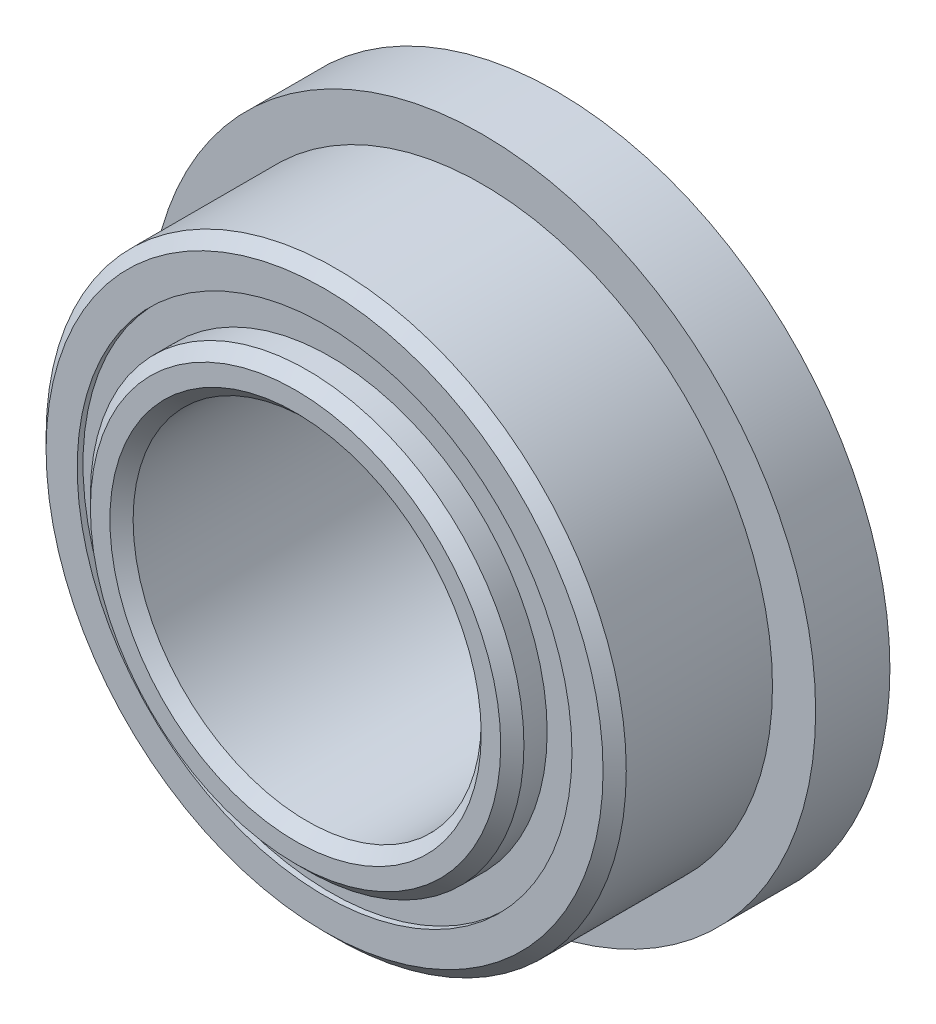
ISO-10303-21;
HEADER;
FILE_DESCRIPTION(('STEP AP214'),'2;1');
FILE_NAME('part.step','',(''),(''),'','','');
FILE_SCHEMA(('AUTOMOTIVE_DESIGN { 1 0 10303 214 1 1 1 1 }'));
ENDSEC;
DATA;
#1=APPLICATION_CONTEXT('core data for automotive mechanical design processes');
#2=APPLICATION_PROTOCOL_DEFINITION('international standard','automotive_design',2000,#1);
#3=PRODUCT_CONTEXT('',#1,'mechanical');
#4=PRODUCT('Part','Part','',(#3));
#5=PRODUCT_RELATED_PRODUCT_CATEGORY('part','',(#4));
#6=PRODUCT_DEFINITION_FORMATION('','',#4);
#7=PRODUCT_DEFINITION_CONTEXT('part definition',#1,'design');
#8=PRODUCT_DEFINITION('design','',#6,#7);
#9=PRODUCT_DEFINITION_SHAPE('','',#8);
#10=(LENGTH_UNIT() NAMED_UNIT(*) SI_UNIT(.MILLI.,.METRE.));
#11=(NAMED_UNIT(*) PLANE_ANGLE_UNIT() SI_UNIT($,.RADIAN.));
#12=(NAMED_UNIT(*) SI_UNIT($,.STERADIAN.) SOLID_ANGLE_UNIT());
#13=UNCERTAINTY_MEASURE_WITH_UNIT(LENGTH_MEASURE(1.E-05),#10,'distance_accuracy_value','');
#14=(GEOMETRIC_REPRESENTATION_CONTEXT(3) GLOBAL_UNCERTAINTY_ASSIGNED_CONTEXT((#13)) GLOBAL_UNIT_ASSIGNED_CONTEXT((#10,
#11,#12)) REPRESENTATION_CONTEXT('',''));
#15=CARTESIAN_POINT('',(0.,0.,0.));
#16=DIRECTION('',(0.,0.,1.));
#17=DIRECTION('',(1.,0.,0.));
#18=AXIS2_PLACEMENT_3D('',#15,#16,#17);
#19=CARTESIAN_POINT('',(0.,3.38434065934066,-1.508125));
#20=DIRECTION('',(0.,0.,1.));
#21=DIRECTION('',(1.,0.,0.));
#22=AXIS2_PLACEMENT_3D('',#19,#20,#21);
#23=PLANE('',#22);
#24=CARTESIAN_POINT('',(0.,0.,-1.508125));
#25=DIRECTION('',(0.,0.,1.));
#26=DIRECTION('',(1.,0.,0.));
#27=AXIS2_PLACEMENT_3D('',#24,#25,#26);
#28=CIRCLE('',#27,3.38434065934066);
#29=CARTESIAN_POINT('',(3.38434065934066,0.,-1.508125));
#30=VERTEX_POINT('',#29);
#31=EDGE_CURVE('E55',#30,#30,#28,.T.);
#32=ORIENTED_EDGE('',*,*,#31,.F.);
#33=EDGE_LOOP('',(#32));
#34=FACE_BOUND('',#33,.T.);
#35=CARTESIAN_POINT('',(0.,0.,-1.508125));
#36=DIRECTION('',(0.,0.,1.));
#37=DIRECTION('',(1.,0.,0.));
#38=AXIS2_PLACEMENT_3D('',#35,#36,#37);
#39=CIRCLE('',#38,2.96565934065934);
#40=CARTESIAN_POINT('',(2.96565934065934,0.,-1.508125));
#41=VERTEX_POINT('',#40);
#42=EDGE_CURVE('E11',#41,#41,#39,.T.);
#43=ORIENTED_EDGE('',*,*,#42,.T.);
#44=EDGE_LOOP('',(#43));
#45=FACE_BOUND('',#44,.T.);
#46=ADVANCED_FACE('F41',(#34,#45),#23,.F.);
#47=CARTESIAN_POINT('',(0.,0.,1.5875));
#48=DIRECTION('',(0.,0.,1.));
#49=DIRECTION('',(1.,0.,0.));
#50=AXIS2_PLACEMENT_3D('',#47,#48,#49);
#51=CYLINDRICAL_SURFACE('',#50,2.96565934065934);
#52=ORIENTED_EDGE('',*,*,#42,.F.);
#53=EDGE_LOOP('',(#52));
#54=FACE_BOUND('',#53,.T.);
#55=CARTESIAN_POINT('',(0.,0.,-0.735956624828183));
#56=DIRECTION('',(0.,0.,1.));
#57=DIRECTION('',(1.,0.,0.));
#58=AXIS2_PLACEMENT_3D('',#55,#56,#57);
#59=CIRCLE('',#58,2.96565934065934);
#60=CARTESIAN_POINT('',(2.96565934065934,0.,-0.735956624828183));
#61=VERTEX_POINT('',#60);
#62=EDGE_CURVE('E47',#61,#61,#59,.T.);
#63=ORIENTED_EDGE('',*,*,#62,.T.);
#64=EDGE_LOOP('',(#63));
#65=FACE_BOUND('',#64,.T.);
#66=ADVANCED_FACE('F64',(#54,#65),#51,.F.);
#67=CARTESIAN_POINT('',(0.,3.38434065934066,-0.735956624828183));
#68=DIRECTION('',(0.,0.,-1.));
#69=DIRECTION('',(-1.,0.,0.));
#70=AXIS2_PLACEMENT_3D('',#67,#68,#69);
#71=PLANE('',#70);
#72=ORIENTED_EDGE('',*,*,#62,.F.);
#73=EDGE_LOOP('',(#72));
#74=FACE_BOUND('',#73,.T.);
#75=CARTESIAN_POINT('',(0.,0.,-0.735956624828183));
#76=DIRECTION('',(0.,0.,1.));
#77=DIRECTION('',(1.,0.,0.));
#78=AXIS2_PLACEMENT_3D('',#75,#76,#77);
#79=CIRCLE('',#78,3.38434065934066);
#80=CARTESIAN_POINT('',(3.38434065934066,0.,-0.735956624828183));
#81=VERTEX_POINT('',#80);
#82=EDGE_CURVE('E51',#81,#81,#79,.T.);
#83=ORIENTED_EDGE('',*,*,#82,.T.);
#84=EDGE_LOOP('',(#83));
#85=FACE_BOUND('',#84,.T.);
#86=ADVANCED_FACE('F68',(#74,#85),#71,.F.);
#87=CARTESIAN_POINT('',(0.,0.,1.5875));
#88=DIRECTION('',(0.,0.,1.));
#89=DIRECTION('',(1.,0.,0.));
#90=AXIS2_PLACEMENT_3D('',#87,#88,#89);
#91=CYLINDRICAL_SURFACE('',#90,3.38434065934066);
#92=ORIENTED_EDGE('',*,*,#82,.F.);
#93=EDGE_LOOP('',(#92));
#94=FACE_BOUND('',#93,.T.);
#95=ORIENTED_EDGE('',*,*,#31,.T.);
#96=EDGE_LOOP('',(#95));
#97=FACE_BOUND('',#96,.T.);
#98=ADVANCED_FACE('F61',(#94,#97),#91,.T.);
#99=CLOSED_SHELL('',(#46,#66,#86,#98));
#100=MANIFOLD_SOLID_BREP('B2',#99);
#101=CARTESIAN_POINT('',(0.,3.38434065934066,1.508125));
#102=DIRECTION('',(0.,0.,-1.));
#103=DIRECTION('',(-1.,0.,0.));
#104=AXIS2_PLACEMENT_3D('',#101,#102,#103);
#105=PLANE('',#104);
#106=CARTESIAN_POINT('',(0.,0.,1.508125));
#107=DIRECTION('',(0.,0.,1.));
#108=DIRECTION('',(1.,0.,0.));
#109=AXIS2_PLACEMENT_3D('',#106,#107,#108);
#110=CIRCLE('',#109,2.96565934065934);
#111=CARTESIAN_POINT('',(2.96565934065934,0.,1.508125));
#112=VERTEX_POINT('',#111);
#113=EDGE_CURVE('E40',#112,#112,#110,.T.);
#114=ORIENTED_EDGE('',*,*,#113,.F.);
#115=EDGE_LOOP('',(#114));
#116=FACE_BOUND('',#115,.T.);
#117=CARTESIAN_POINT('',(0.,0.,1.508125));
#118=DIRECTION('',(0.,0.,1.));
#119=DIRECTION('',(1.,0.,0.));
#120=AXIS2_PLACEMENT_3D('',#117,#118,#119);
#121=CIRCLE('',#120,3.38434065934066);
#122=CARTESIAN_POINT('',(3.38434065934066,0.,1.508125));
#123=VERTEX_POINT('',#122);
#124=EDGE_CURVE('E122',#123,#123,#121,.T.);
#125=ORIENTED_EDGE('',*,*,#124,.T.);
#126=EDGE_LOOP('',(#125));
#127=FACE_BOUND('',#126,.T.);
#128=ADVANCED_FACE('F108',(#116,#127),#105,.F.);
#129=CARTESIAN_POINT('',(0.,0.,1.5875));
#130=DIRECTION('',(0.,0.,1.));
#131=DIRECTION('',(1.,0.,0.));
#132=AXIS2_PLACEMENT_3D('',#129,#130,#131);
#133=CYLINDRICAL_SURFACE('',#132,2.96565934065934);
#134=CARTESIAN_POINT('',(0.,0.,0.735956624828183));
#135=DIRECTION('',(0.,0.,1.));
#136=DIRECTION('',(1.,0.,0.));
#137=AXIS2_PLACEMENT_3D('',#134,#135,#136);
#138=CIRCLE('',#137,2.96565934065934);
#139=CARTESIAN_POINT('',(2.96565934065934,0.,0.735956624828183));
#140=VERTEX_POINT('',#139);
#141=EDGE_CURVE('E114',#140,#140,#138,.T.);
#142=ORIENTED_EDGE('',*,*,#141,.F.);
#143=EDGE_LOOP('',(#142));
#144=FACE_BOUND('',#143,.T.);
#145=ORIENTED_EDGE('',*,*,#113,.T.);
#146=EDGE_LOOP('',(#145));
#147=FACE_BOUND('',#146,.T.);
#148=ADVANCED_FACE('F137',(#144,#147),#133,.F.);
#149=CARTESIAN_POINT('',(0.,3.38434065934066,0.735956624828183));
#150=DIRECTION('',(0.,0.,1.));
#151=DIRECTION('',(1.,0.,0.));
#152=AXIS2_PLACEMENT_3D('',#149,#150,#151);
#153=PLANE('',#152);
#154=CARTESIAN_POINT('',(0.,0.,0.735956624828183));
#155=DIRECTION('',(0.,0.,1.));
#156=DIRECTION('',(1.,0.,0.));
#157=AXIS2_PLACEMENT_3D('',#154,#155,#156);
#158=CIRCLE('',#157,3.38434065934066);
#159=CARTESIAN_POINT('',(3.38434065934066,0.,0.735956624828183));
#160=VERTEX_POINT('',#159);
#161=EDGE_CURVE('E118',#160,#160,#158,.T.);
#162=ORIENTED_EDGE('',*,*,#161,.F.);
#163=EDGE_LOOP('',(#162));
#164=FACE_BOUND('',#163,.T.);
#165=ORIENTED_EDGE('',*,*,#141,.T.);
#166=EDGE_LOOP('',(#165));
#167=FACE_BOUND('',#166,.T.);
#168=ADVANCED_FACE('F132',(#164,#167),#153,.F.);
#169=CARTESIAN_POINT('',(0.,0.,1.5875));
#170=DIRECTION('',(0.,0.,1.));
#171=DIRECTION('',(1.,0.,0.));
#172=AXIS2_PLACEMENT_3D('',#169,#170,#171);
#173=CYLINDRICAL_SURFACE('',#172,3.38434065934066);
#174=ORIENTED_EDGE('',*,*,#124,.F.);
#175=EDGE_LOOP('',(#174));
#176=FACE_BOUND('',#175,.T.);
#177=ORIENTED_EDGE('',*,*,#161,.T.);
#178=EDGE_LOOP('',(#177));
#179=FACE_BOUND('',#178,.T.);
#180=ADVANCED_FACE('F129',(#176,#179),#173,.T.);
#181=CLOSED_SHELL('',(#128,#148,#168,#180));
#182=MANIFOLD_SOLID_BREP('B6',#181);
#183=CARTESIAN_POINT('',(-1.86621817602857,2.56862895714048,0.));
#184=DIRECTION('',(0.,0.,1.));
#185=DIRECTION('',(-0.587785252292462,0.809016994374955,0.));
#186=AXIS2_PLACEMENT_3D('',#183,#184,#185);
#187=SPHERICAL_SURFACE('',#186,0.735956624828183);
#188=CARTESIAN_POINT('',(-1.86621817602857,2.56862895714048,0.735956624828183));
#189=VERTEX_POINT('',#188);
#190=VERTEX_LOOP('',#189);
#191=FACE_BOUND('',#190,.T.);
#192=ADVANCED_FACE('F175',(#191),#187,.T.);
#193=CLOSED_SHELL('',(#192));
#194=MANIFOLD_SOLID_BREP('B35',#193);
#195=CARTESIAN_POINT('',(-3.0196044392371,0.981128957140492,0.));
#196=DIRECTION('',(0.,0.,1.));
#197=DIRECTION('',(-0.95105651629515,0.309016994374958,0.));
#198=AXIS2_PLACEMENT_3D('',#195,#196,#197);
#199=SPHERICAL_SURFACE('',#198,0.735956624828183);
#200=CARTESIAN_POINT('',(-3.0196044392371,0.981128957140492,0.735956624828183));
#201=VERTEX_POINT('',#200);
#202=VERTEX_LOOP('',#201);
#203=FACE_BOUND('',#202,.T.);
#204=ADVANCED_FACE('F195',(#203),#199,.T.);
#205=CLOSED_SHELL('',(#204));
#206=MANIFOLD_SOLID_BREP('B104',#205);
#207=CARTESIAN_POINT('',(-3.01960443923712,-0.981128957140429,0.));
#208=DIRECTION('',(0.,0.,1.));
#209=DIRECTION('',(-0.951056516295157,-0.309016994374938,0.));
#210=AXIS2_PLACEMENT_3D('',#207,#208,#209);
#211=SPHERICAL_SURFACE('',#210,0.735956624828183);
#212=CARTESIAN_POINT('',(-3.01960443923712,-0.981128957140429,0.735956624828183));
#213=VERTEX_POINT('',#212);
#214=VERTEX_LOOP('',#213);
#215=FACE_BOUND('',#214,.T.);
#216=ADVANCED_FACE('F215',(#215),#211,.T.);
#217=CLOSED_SHELL('',(#216));
#218=MANIFOLD_SOLID_BREP('B171',#217);
#219=CARTESIAN_POINT('',(-1.86621817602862,-2.56862895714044,0.));
#220=DIRECTION('',(0.,0.,1.));
#221=DIRECTION('',(-0.58778525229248,-0.809016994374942,0.));
#222=AXIS2_PLACEMENT_3D('',#219,#220,#221);
#223=SPHERICAL_SURFACE('',#222,0.735956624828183);
#224=CARTESIAN_POINT('',(-1.86621817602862,-2.56862895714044,0.735956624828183));
#225=VERTEX_POINT('',#224);
#226=VERTEX_LOOP('',#225);
#227=FACE_BOUND('',#226,.T.);
#228=ADVANCED_FACE('F235',(#227),#223,.T.);
#229=CLOSED_SHELL('',(#228));
#230=MANIFOLD_SOLID_BREP('B191',#229);
#231=CARTESIAN_POINT('',(0.,-3.175,0.));
#232=DIRECTION('',(0.,0.,1.));
#233=DIRECTION('',(0.,-1.,0.));
#234=AXIS2_PLACEMENT_3D('',#231,#232,#233);
#235=SPHERICAL_SURFACE('',#234,0.735956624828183);
#236=CARTESIAN_POINT('',(0.,-3.175,0.735956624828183));
#237=VERTEX_POINT('',#236);
#238=VERTEX_LOOP('',#237);
#239=FACE_BOUND('',#238,.T.);
#240=ADVANCED_FACE('F255',(#239),#235,.T.);
#241=CLOSED_SHELL('',(#240));
#242=MANIFOLD_SOLID_BREP('B211',#241);
#243=CARTESIAN_POINT('',(1.86621817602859,-2.56862895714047,0.));
#244=DIRECTION('',(0.,0.,1.));
#245=DIRECTION('',(0.587785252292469,-0.809016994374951,0.));
#246=AXIS2_PLACEMENT_3D('',#243,#244,#245);
#247=SPHERICAL_SURFACE('',#246,0.735956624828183);
#248=CARTESIAN_POINT('',(1.86621817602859,-2.56862895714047,0.735956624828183));
#249=VERTEX_POINT('',#248);
#250=VERTEX_LOOP('',#249);
#251=FACE_BOUND('',#250,.T.);
#252=ADVANCED_FACE('F275',(#251),#247,.T.);
#253=CLOSED_SHELL('',(#252));
#254=MANIFOLD_SOLID_BREP('B231',#253);
#255=CARTESIAN_POINT('',(3.01960443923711,-0.981128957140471,0.));
#256=DIRECTION('',(0.,0.,1.));
#257=DIRECTION('',(0.951056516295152,-0.309016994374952,0.));
#258=AXIS2_PLACEMENT_3D('',#255,#256,#257);
#259=SPHERICAL_SURFACE('',#258,0.735956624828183);
#260=CARTESIAN_POINT('',(3.01960443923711,-0.981128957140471,0.735956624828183));
#261=VERTEX_POINT('',#260);
#262=VERTEX_LOOP('',#261);
#263=FACE_BOUND('',#262,.T.);
#264=ADVANCED_FACE('F295',(#263),#259,.T.);
#265=CLOSED_SHELL('',(#264));
#266=MANIFOLD_SOLID_BREP('B251',#265);
#267=CARTESIAN_POINT('',(3.01960443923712,0.98112895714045,0.));
#268=DIRECTION('',(0.,0.,1.));
#269=DIRECTION('',(0.951056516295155,0.309016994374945,0.));
#270=AXIS2_PLACEMENT_3D('',#267,#268,#269);
#271=SPHERICAL_SURFACE('',#270,0.735956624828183);
#272=CARTESIAN_POINT('',(3.01960443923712,0.98112895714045,0.735956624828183));
#273=VERTEX_POINT('',#272);
#274=VERTEX_LOOP('',#273);
#275=FACE_BOUND('',#274,.T.);
#276=ADVANCED_FACE('F315',(#275),#271,.T.);
#277=CLOSED_SHELL('',(#276));
#278=MANIFOLD_SOLID_BREP('B271',#277);
#279=CARTESIAN_POINT('',(1.86621817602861,2.56862895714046,0.));
#280=DIRECTION('',(0.,0.,1.));
#281=DIRECTION('',(0.587785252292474,0.809016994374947,0.));
#282=AXIS2_PLACEMENT_3D('',#279,#280,#281);
#283=SPHERICAL_SURFACE('',#282,0.735956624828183);
#284=CARTESIAN_POINT('',(1.86621817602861,2.56862895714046,0.735956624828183));
#285=VERTEX_POINT('',#284);
#286=VERTEX_LOOP('',#285);
#287=FACE_BOUND('',#286,.T.);
#288=ADVANCED_FACE('F335',(#287),#283,.T.);
#289=CLOSED_SHELL('',(#288));
#290=MANIFOLD_SOLID_BREP('B291',#289);
#291=CARTESIAN_POINT('',(0.,3.175,0.));
#292=DIRECTION('',(0.,0.,1.));
#293=DIRECTION('',(0.,1.,0.));
#294=AXIS2_PLACEMENT_3D('',#291,#292,#293);
#295=SPHERICAL_SURFACE('',#294,0.735956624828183);
#296=CARTESIAN_POINT('',(0.,3.175,0.735956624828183));
#297=VERTEX_POINT('',#296);
#298=VERTEX_LOOP('',#297);
#299=FACE_BOUND('',#298,.T.);
#300=ADVANCED_FACE('F357',(#299),#295,.T.);
#301=CLOSED_SHELL('',(#300));
#302=MANIFOLD_SOLID_BREP('B311',#301);
#303=CARTESIAN_POINT('',(0.,0.,1.825625));
#304=DIRECTION('',(0.,0.,-1.));
#305=DIRECTION('',(-1.,0.,0.));
#306=AXIS2_PLACEMENT_3D('',#303,#304,#305);
#307=CONICAL_SURFACE('',#306,2.96565934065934,0.785398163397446);
#308=CARTESIAN_POINT('',(0.,0.,1.984375));
#309=DIRECTION('',(0.,0.,1.));
#310=DIRECTION('',(1.,0.,0.));
#311=AXIS2_PLACEMENT_3D('',#308,#309,#310);
#312=CIRCLE('',#311,2.80690934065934);
#313=CARTESIAN_POINT('',(2.80690934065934,0.,1.984375));
#314=VERTEX_POINT('',#313);
#315=EDGE_CURVE('E410',#314,#314,#312,.T.);
#316=ORIENTED_EDGE('',*,*,#315,.F.);
#317=EDGE_LOOP('',(#316));
#318=FACE_BOUND('',#317,.T.);
#319=CARTESIAN_POINT('',(0.,0.,1.825625));
#320=DIRECTION('',(0.,0.,1.));
#321=DIRECTION('',(1.,0.,0.));
#322=AXIS2_PLACEMENT_3D('',#319,#320,#321);
#323=CIRCLE('',#322,2.96565934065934);
#324=CARTESIAN_POINT('',(2.96565934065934,0.,1.825625));
#325=VERTEX_POINT('',#324);
#326=EDGE_CURVE('E356',#325,#325,#323,.T.);
#327=ORIENTED_EDGE('',*,*,#326,.T.);
#328=EDGE_LOOP('',(#327));
#329=FACE_BOUND('',#328,.T.);
#330=ADVANCED_FACE('F376',(#318,#329),#307,.T.);
#331=CARTESIAN_POINT('',(0.,0.,1.5875));
#332=DIRECTION('',(0.,0.,1.));
#333=DIRECTION('',(1.,0.,0.));
#334=AXIS2_PLACEMENT_3D('',#331,#332,#333);
#335=CYLINDRICAL_SURFACE('',#334,2.96565934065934);
#336=ORIENTED_EDGE('',*,*,#326,.F.);
#337=EDGE_LOOP('',(#336));
#338=FACE_BOUND('',#337,.T.);
#339=CARTESIAN_POINT('',(0.,0.,0.705555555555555));
#340=DIRECTION('',(0.,0.,1.));
#341=DIRECTION('',(1.,0.,0.));
#342=AXIS2_PLACEMENT_3D('',#339,#340,#341);
#343=CIRCLE('',#342,2.96565934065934);
#344=CARTESIAN_POINT('',(2.96565934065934,0.,0.705555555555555));
#345=VERTEX_POINT('',#344);
#346=EDGE_CURVE('E382',#345,#345,#343,.T.);
#347=ORIENTED_EDGE('',*,*,#346,.T.);
#348=EDGE_LOOP('',(#347));
#349=FACE_BOUND('',#348,.T.);
#350=ADVANCED_FACE('F417',(#338,#349),#335,.T.);
#351=CARTESIAN_POINT('',(0.,0.,0.));
#352=DIRECTION('',(0.,0.,1.));
#353=DIRECTION('',(1.,0.,0.));
#354=AXIS2_PLACEMENT_3D('',#351,#352,#353);
#355=TOROIDAL_SURFACE('',#354,3.175,0.735956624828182);
#356=ORIENTED_EDGE('',*,*,#346,.F.);
#357=EDGE_LOOP('',(#356));
#358=FACE_BOUND('',#357,.T.);
#359=CARTESIAN_POINT('',(0.,0.,-0.705555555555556));
#360=DIRECTION('',(0.,0.,1.));
#361=DIRECTION('',(1.,0.,0.));
#362=AXIS2_PLACEMENT_3D('',#359,#360,#361);
#363=CIRCLE('',#362,2.96565934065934);
#364=CARTESIAN_POINT('',(2.96565934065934,0.,-0.705555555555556));
#365=VERTEX_POINT('',#364);
#366=EDGE_CURVE('E386',#365,#365,#363,.T.);
#367=ORIENTED_EDGE('',*,*,#366,.T.);
#368=EDGE_LOOP('',(#367));
#369=FACE_BOUND('',#368,.T.);
#370=ADVANCED_FACE('F421',(#358,#369),#355,.F.);
#371=CARTESIAN_POINT('',(0.,0.,1.5875));
#372=DIRECTION('',(0.,0.,1.));
#373=DIRECTION('',(1.,0.,0.));
#374=AXIS2_PLACEMENT_3D('',#371,#372,#373);
#375=CYLINDRICAL_SURFACE('',#374,2.96565934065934);
#376=ORIENTED_EDGE('',*,*,#366,.F.);
#377=EDGE_LOOP('',(#376));
#378=FACE_BOUND('',#377,.T.);
#379=CARTESIAN_POINT('',(0.,0.,-1.825625));
#380=DIRECTION('',(0.,0.,1.));
#381=DIRECTION('',(1.,0.,0.));
#382=AXIS2_PLACEMENT_3D('',#379,#380,#381);
#383=CIRCLE('',#382,2.96565934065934);
#384=CARTESIAN_POINT('',(2.96565934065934,0.,-1.825625));
#385=VERTEX_POINT('',#384);
#386=EDGE_CURVE('E390',#385,#385,#383,.T.);
#387=ORIENTED_EDGE('',*,*,#386,.T.);
#388=EDGE_LOOP('',(#387));
#389=FACE_BOUND('',#388,.T.);
#390=ADVANCED_FACE('F426',(#378,#389),#375,.T.);
#391=CARTESIAN_POINT('',(0.,0.,-1.984375));
#392=DIRECTION('',(0.,0.,1.));
#393=DIRECTION('',(1.,0.,0.));
#394=AXIS2_PLACEMENT_3D('',#391,#392,#393);
#395=CONICAL_SURFACE('',#394,2.80690934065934,0.78539816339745);
#396=ORIENTED_EDGE('',*,*,#386,.F.);
#397=EDGE_LOOP('',(#396));
#398=FACE_BOUND('',#397,.T.);
#399=CARTESIAN_POINT('',(0.,0.,-1.984375));
#400=DIRECTION('',(0.,0.,1.));
#401=DIRECTION('',(1.,0.,0.));
#402=AXIS2_PLACEMENT_3D('',#399,#400,#401);
#403=CIRCLE('',#402,2.80690934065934);
#404=CARTESIAN_POINT('',(2.80690934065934,0.,-1.984375));
#405=VERTEX_POINT('',#404);
#406=EDGE_CURVE('E395',#405,#405,#403,.T.);
#407=ORIENTED_EDGE('',*,*,#406,.T.);
#408=EDGE_LOOP('',(#407));
#409=FACE_BOUND('',#408,.T.);
#410=ADVANCED_FACE('F432',(#398,#409),#395,.T.);
#411=CARTESIAN_POINT('',(0.,2.80690934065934,-1.984375));
#412=DIRECTION('',(0.,0.,1.));
#413=DIRECTION('',(1.,0.,0.));
#414=AXIS2_PLACEMENT_3D('',#411,#412,#413);
#415=PLANE('',#414);
#416=ORIENTED_EDGE('',*,*,#406,.F.);
#417=EDGE_LOOP('',(#416));
#418=FACE_BOUND('',#417,.T.);
#419=CARTESIAN_POINT('',(0.,0.,-1.984375));
#420=DIRECTION('',(0.,0.,1.));
#421=DIRECTION('',(1.,0.,0.));
#422=AXIS2_PLACEMENT_3D('',#419,#420,#421);
#423=CIRCLE('',#422,2.54);
#424=CARTESIAN_POINT('',(2.54,0.,-1.984375));
#425=VERTEX_POINT('',#424);
#426=EDGE_CURVE('E398',#425,#425,#423,.T.);
#427=ORIENTED_EDGE('',*,*,#426,.T.);
#428=EDGE_LOOP('',(#427));
#429=FACE_BOUND('',#428,.T.);
#430=ADVANCED_FACE('F436',(#418,#429),#415,.F.);
#431=CARTESIAN_POINT('',(0.,0.,-1.825625));
#432=DIRECTION('',(0.,0.,-1.));
#433=DIRECTION('',(-1.,0.,0.));
#434=AXIS2_PLACEMENT_3D('',#431,#432,#433);
#435=CONICAL_SURFACE('',#434,2.38125,0.785398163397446);
#436=ORIENTED_EDGE('',*,*,#426,.F.);
#437=EDGE_LOOP('',(#436));
#438=FACE_BOUND('',#437,.T.);
#439=CARTESIAN_POINT('',(0.,0.,-1.825625));
#440=DIRECTION('',(0.,0.,1.));
#441=DIRECTION('',(1.,0.,0.));
#442=AXIS2_PLACEMENT_3D('',#439,#440,#441);
#443=CIRCLE('',#442,2.38125);
#444=CARTESIAN_POINT('',(2.38125,0.,-1.825625));
#445=VERTEX_POINT('',#444);
#446=EDGE_CURVE('E401',#445,#445,#443,.T.);
#447=ORIENTED_EDGE('',*,*,#446,.T.);
#448=EDGE_LOOP('',(#447));
#449=FACE_BOUND('',#448,.T.);
#450=ADVANCED_FACE('F440',(#438,#449),#435,.F.);
#451=CARTESIAN_POINT('',(0.,0.,1.5875));
#452=DIRECTION('',(0.,0.,1.));
#453=DIRECTION('',(1.,0.,0.));
#454=AXIS2_PLACEMENT_3D('',#451,#452,#453);
#455=CYLINDRICAL_SURFACE('',#454,2.38125);
#456=ORIENTED_EDGE('',*,*,#446,.F.);
#457=EDGE_LOOP('',(#456));
#458=FACE_BOUND('',#457,.T.);
#459=CARTESIAN_POINT('',(0.,0.,1.825625));
#460=DIRECTION('',(0.,0.,1.));
#461=DIRECTION('',(1.,0.,0.));
#462=AXIS2_PLACEMENT_3D('',#459,#460,#461);
#463=CIRCLE('',#462,2.38125);
#464=CARTESIAN_POINT('',(2.38125,0.,1.825625));
#465=VERTEX_POINT('',#464);
#466=EDGE_CURVE('E404',#465,#465,#463,.T.);
#467=ORIENTED_EDGE('',*,*,#466,.T.);
#468=EDGE_LOOP('',(#467));
#469=FACE_BOUND('',#468,.T.);
#470=ADVANCED_FACE('F444',(#458,#469),#455,.F.);
#471=CARTESIAN_POINT('',(0.,0.,1.984375));
#472=DIRECTION('',(0.,0.,1.));
#473=DIRECTION('',(1.,0.,0.));
#474=AXIS2_PLACEMENT_3D('',#471,#472,#473);
#475=CONICAL_SURFACE('',#474,2.54,0.785398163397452);
#476=ORIENTED_EDGE('',*,*,#466,.F.);
#477=EDGE_LOOP('',(#476));
#478=FACE_BOUND('',#477,.T.);
#479=CARTESIAN_POINT('',(0.,0.,1.984375));
#480=DIRECTION('',(0.,0.,1.));
#481=DIRECTION('',(1.,0.,0.));
#482=AXIS2_PLACEMENT_3D('',#479,#480,#481);
#483=CIRCLE('',#482,2.54);
#484=CARTESIAN_POINT('',(2.54,0.,1.984375));
#485=VERTEX_POINT('',#484);
#486=EDGE_CURVE('E407',#485,#485,#483,.T.);
#487=ORIENTED_EDGE('',*,*,#486,.T.);
#488=EDGE_LOOP('',(#487));
#489=FACE_BOUND('',#488,.T.);
#490=ADVANCED_FACE('F448',(#478,#489),#475,.F.);
#491=CARTESIAN_POINT('',(0.,2.54,1.984375));
#492=DIRECTION('',(0.,0.,-1.));
#493=DIRECTION('',(-1.,0.,0.));
#494=AXIS2_PLACEMENT_3D('',#491,#492,#493);
#495=PLANE('',#494);
#496=ORIENTED_EDGE('',*,*,#486,.F.);
#497=EDGE_LOOP('',(#496));
#498=FACE_BOUND('',#497,.T.);
#499=ORIENTED_EDGE('',*,*,#315,.T.);
#500=EDGE_LOOP('',(#499));
#501=FACE_BOUND('',#500,.T.);
#502=ADVANCED_FACE('F414',(#498,#501),#495,.F.);
#503=CLOSED_SHELL('',(#330,#350,#370,#390,#410,#430,#450,#470,#490,#502));
#504=MANIFOLD_SOLID_BREP('B331',#503);
#505=CARTESIAN_POINT('',(0.,0.,1.42875));
#506=DIRECTION('',(0.,0.,-1.));
#507=DIRECTION('',(-1.,0.,0.));
#508=AXIS2_PLACEMENT_3D('',#505,#506,#507);
#509=CONICAL_SURFACE('',#508,3.96875,0.785398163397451);
#510=CARTESIAN_POINT('',(0.,0.,1.5875));
#511=DIRECTION('',(0.,0.,1.));
#512=DIRECTION('',(1.,0.,0.));
#513=AXIS2_PLACEMENT_3D('',#510,#511,#512);
#514=CIRCLE('',#513,3.81);
#515=CARTESIAN_POINT('',(3.81,0.,1.5875));
#516=VERTEX_POINT('',#515);
#517=EDGE_CURVE('E546',#516,#516,#514,.T.);
#518=ORIENTED_EDGE('',*,*,#517,.F.);
#519=EDGE_LOOP('',(#518));
#520=FACE_BOUND('',#519,.T.);
#521=CARTESIAN_POINT('',(0.,0.,1.42875));
#522=DIRECTION('',(0.,0.,1.));
#523=DIRECTION('',(1.,0.,0.));
#524=AXIS2_PLACEMENT_3D('',#521,#522,#523);
#525=CIRCLE('',#524,3.96875);
#526=CARTESIAN_POINT('',(3.96875,0.,1.42875));
#527=VERTEX_POINT('',#526);
#528=EDGE_CURVE('E375',#527,#527,#525,.T.);
#529=ORIENTED_EDGE('',*,*,#528,.T.);
#530=EDGE_LOOP('',(#529));
#531=FACE_BOUND('',#530,.T.);
#532=ADVANCED_FACE('F527',(#520,#531),#509,.T.);
#533=CARTESIAN_POINT('',(0.,0.,1.5875));
#534=DIRECTION('',(0.,0.,1.));
#535=DIRECTION('',(1.,0.,0.));
#536=AXIS2_PLACEMENT_3D('',#533,#534,#535);
#537=CYLINDRICAL_SURFACE('',#536,3.96875);
#538=CARTESIAN_POINT('',(0.,0.,-0.5715));
#539=DIRECTION('',(0.,0.,1.));
#540=DIRECTION('',(1.,0.,0.));
#541=AXIS2_PLACEMENT_3D('',#538,#539,#540);
#542=CIRCLE('',#541,3.96875);
#543=CARTESIAN_POINT('',(3.96875,0.,-0.5715));
#544=VERTEX_POINT('',#543);
#545=EDGE_CURVE('E549',#544,#544,#542,.T.);
#546=ORIENTED_EDGE('',*,*,#545,.T.);
#547=EDGE_LOOP('',(#546));
#548=FACE_BOUND('',#547,.T.);
#549=ORIENTED_EDGE('',*,*,#528,.F.);
#550=EDGE_LOOP('',(#549));
#551=FACE_BOUND('',#550,.T.);
#552=ADVANCED_FACE('F583',(#548,#551),#537,.T.);
#553=CARTESIAN_POINT('',(0.,0.,0.));
#554=DIRECTION('',(0.,0.,1.));
#555=DIRECTION('',(1.,0.,0.));
#556=AXIS2_PLACEMENT_3D('',#553,#554,#555);
#557=TOROIDAL_SURFACE('',#556,3.175,0.735956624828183);
#558=CARTESIAN_POINT('',(0.,0.,-0.5715));
#559=DIRECTION('',(0.,0.,1.));
#560=DIRECTION('',(1.,0.,0.));
#561=AXIS2_PLACEMENT_3D('',#558,#559,#560);
#562=CIRCLE('',#561,3.63870238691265);
#563=CARTESIAN_POINT('',(3.63870238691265,0.,-0.5715));
#564=VERTEX_POINT('',#563);
#565=EDGE_CURVE('E530',#564,#564,#562,.F.);
#566=ORIENTED_EDGE('',*,*,#565,.T.);
#567=EDGE_LOOP('',(#566));
#568=FACE_BOUND('',#567,.T.);
#569=CARTESIAN_POINT('',(0.,0.,0.705555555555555));
#570=DIRECTION('',(0.,0.,1.));
#571=DIRECTION('',(1.,0.,0.));
#572=AXIS2_PLACEMENT_3D('',#569,#570,#571);
#573=CIRCLE('',#572,3.38434065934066);
#574=CARTESIAN_POINT('',(3.38434065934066,0.,0.705555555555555));
#575=VERTEX_POINT('',#574);
#576=EDGE_CURVE('E538',#575,#575,#573,.T.);
#577=ORIENTED_EDGE('',*,*,#576,.T.);
#578=EDGE_LOOP('',(#577));
#579=FACE_BOUND('',#578,.T.);
#580=ADVANCED_FACE('F588',(#568,#579),#557,.F.);
#581=CARTESIAN_POINT('',(0.,0.,1.5875));
#582=DIRECTION('',(0.,0.,1.));
#583=DIRECTION('',(1.,0.,0.));
#584=AXIS2_PLACEMENT_3D('',#581,#582,#583);
#585=CYLINDRICAL_SURFACE('',#584,3.38434065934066);
#586=ORIENTED_EDGE('',*,*,#576,.F.);
#587=EDGE_LOOP('',(#586));
#588=FACE_BOUND('',#587,.T.);
#589=CARTESIAN_POINT('',(0.,0.,1.5875));
#590=DIRECTION('',(0.,0.,1.));
#591=DIRECTION('',(1.,0.,0.));
#592=AXIS2_PLACEMENT_3D('',#589,#590,#591);
#593=CIRCLE('',#592,3.38434065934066);
#594=CARTESIAN_POINT('',(3.38434065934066,0.,1.5875));
#595=VERTEX_POINT('',#594);
#596=EDGE_CURVE('E543',#595,#595,#593,.T.);
#597=ORIENTED_EDGE('',*,*,#596,.T.);
#598=EDGE_LOOP('',(#597));
#599=FACE_BOUND('',#598,.T.);
#600=ADVANCED_FACE('F594',(#588,#599),#585,.F.);
#601=CARTESIAN_POINT('',(0.,3.81,1.5875));
#602=DIRECTION('',(0.,0.,-1.));
#603=DIRECTION('',(-1.,0.,0.));
#604=AXIS2_PLACEMENT_3D('',#601,#602,#603);
#605=PLANE('',#604);
#606=ORIENTED_EDGE('',*,*,#596,.F.);
#607=EDGE_LOOP('',(#606));
#608=FACE_BOUND('',#607,.T.);
#609=ORIENTED_EDGE('',*,*,#517,.T.);
#610=EDGE_LOOP('',(#609));
#611=FACE_BOUND('',#610,.T.);
#612=ADVANCED_FACE('F592',(#608,#611),#605,.F.);
#613=CARTESIAN_POINT('',(0.,3.38434065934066,-0.5715));
#614=DIRECTION('',(0.,0.,1.));
#615=DIRECTION('',(1.,0.,0.));
#616=AXIS2_PLACEMENT_3D('',#613,#614,#615);
#617=PLANE('',#616);
#618=CARTESIAN_POINT('',(0.,0.,-0.5715));
#619=DIRECTION('',(0.,0.,-1.));
#620=DIRECTION('',(-1.,0.,0.));
#621=AXIS2_PLACEMENT_3D('',#618,#619,#620);
#622=CIRCLE('',#621,3.38434065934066);
#623=CARTESIAN_POINT('',(-3.38434065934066,0.,-0.5715));
#624=VERTEX_POINT('',#623);
#625=EDGE_CURVE('E558',#624,#624,#622,.T.);
#626=ORIENTED_EDGE('',*,*,#625,.T.);
#627=EDGE_LOOP('',(#626));
#628=FACE_BOUND('',#627,.T.);
#629=ORIENTED_EDGE('',*,*,#565,.F.);
#630=EDGE_LOOP('',(#629));
#631=FACE_BOUND('',#630,.T.);
#632=ADVANCED_FACE('F562',(#628,#631),#617,.T.);
#633=CARTESIAN_POINT('',(0.,0.,-0.5715));
#634=DIRECTION('',(0.,0.,-1.));
#635=DIRECTION('',(-1.,0.,0.));
#636=AXIS2_PLACEMENT_3D('',#633,#634,#635);
#637=CIRCLE('',#636,4.5593);
#638=CARTESIAN_POINT('',(-4.5593,0.,-0.5715));
#639=VERTEX_POINT('',#638);
#640=EDGE_CURVE('E555',#639,#639,#637,.T.);
#641=ORIENTED_EDGE('',*,*,#640,.F.);
#642=EDGE_LOOP('',(#641));
#643=FACE_BOUND('',#642,.T.);
#644=ORIENTED_EDGE('',*,*,#545,.F.);
#645=EDGE_LOOP('',(#644));
#646=FACE_BOUND('',#645,.T.);
#647=ADVANCED_FACE('F577',(#643,#646),#617,.T.);
#648=CARTESIAN_POINT('',(0.,0.,-1.5875));
#649=DIRECTION('',(0.,0.,-1.));
#650=DIRECTION('',(-1.,0.,0.));
#651=AXIS2_PLACEMENT_3D('',#648,#649,#650);
#652=CYLINDRICAL_SURFACE('',#651,4.5593);
#653=ORIENTED_EDGE('',*,*,#640,.T.);
#654=EDGE_LOOP('',(#653));
#655=FACE_BOUND('',#654,.T.);
#656=CARTESIAN_POINT('',(0.,0.,-1.5875));
#657=DIRECTION('',(0.,0.,-1.));
#658=DIRECTION('',(-1.,0.,0.));
#659=AXIS2_PLACEMENT_3D('',#656,#657,#658);
#660=CIRCLE('',#659,4.5593);
#661=CARTESIAN_POINT('',(-4.5593,0.,-1.5875));
#662=VERTEX_POINT('',#661);
#663=EDGE_CURVE('E552',#662,#662,#660,.T.);
#664=ORIENTED_EDGE('',*,*,#663,.F.);
#665=EDGE_LOOP('',(#664));
#666=FACE_BOUND('',#665,.T.);
#667=ADVANCED_FACE('F568',(#655,#666),#652,.T.);
#668=CARTESIAN_POINT('',(0.,0.,1.5875));
#669=DIRECTION('',(0.,0.,1.));
#670=DIRECTION('',(1.,0.,0.));
#671=AXIS2_PLACEMENT_3D('',#668,#669,#670);
#672=CYLINDRICAL_SURFACE('',#671,3.38434065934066);
#673=CARTESIAN_POINT('',(0.,0.,-1.5875));
#674=DIRECTION('',(0.,0.,1.));
#675=DIRECTION('',(1.,0.,0.));
#676=AXIS2_PLACEMENT_3D('',#673,#674,#675);
#677=CIRCLE('',#676,3.38434065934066);
#678=CARTESIAN_POINT('',(3.38434065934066,0.,-1.5875));
#679=VERTEX_POINT('',#678);
#680=EDGE_CURVE('E534',#679,#679,#677,.T.);
#681=ORIENTED_EDGE('',*,*,#680,.F.);
#682=EDGE_LOOP('',(#681));
#683=FACE_BOUND('',#682,.T.);
#684=ORIENTED_EDGE('',*,*,#625,.F.);
#685=EDGE_LOOP('',(#684));
#686=FACE_BOUND('',#685,.T.);
#687=ADVANCED_FACE('F565',(#683,#686),#672,.F.);
#688=CARTESIAN_POINT('',(0.,3.81,-1.5875));
#689=DIRECTION('',(0.,0.,1.));
#690=DIRECTION('',(1.,0.,0.));
#691=AXIS2_PLACEMENT_3D('',#688,#689,#690);
#692=PLANE('',#691);
#693=ORIENTED_EDGE('',*,*,#680,.T.);
#694=EDGE_LOOP('',(#693));
#695=FACE_BOUND('',#694,.T.);
#696=ORIENTED_EDGE('',*,*,#663,.T.);
#697=EDGE_LOOP('',(#696));
#698=FACE_BOUND('',#697,.T.);
#699=ADVANCED_FACE('F567',(#695,#698),#692,.F.);
#700=CLOSED_SHELL('',(#532,#552,#580,#600,#612,#632,#647,#667,#687,#699));
#701=MANIFOLD_SOLID_BREP('B351',#700);
#702=ADVANCED_BREP_SHAPE_REPRESENTATION('',(#18,#100,#182,#194,#206,#218,#230,#242,#254,#266,
#278,#290,#302,#504,#701),#14);
#703=SHAPE_DEFINITION_REPRESENTATION(#9,#702);
ENDSEC;
END-ISO-10303-21;
